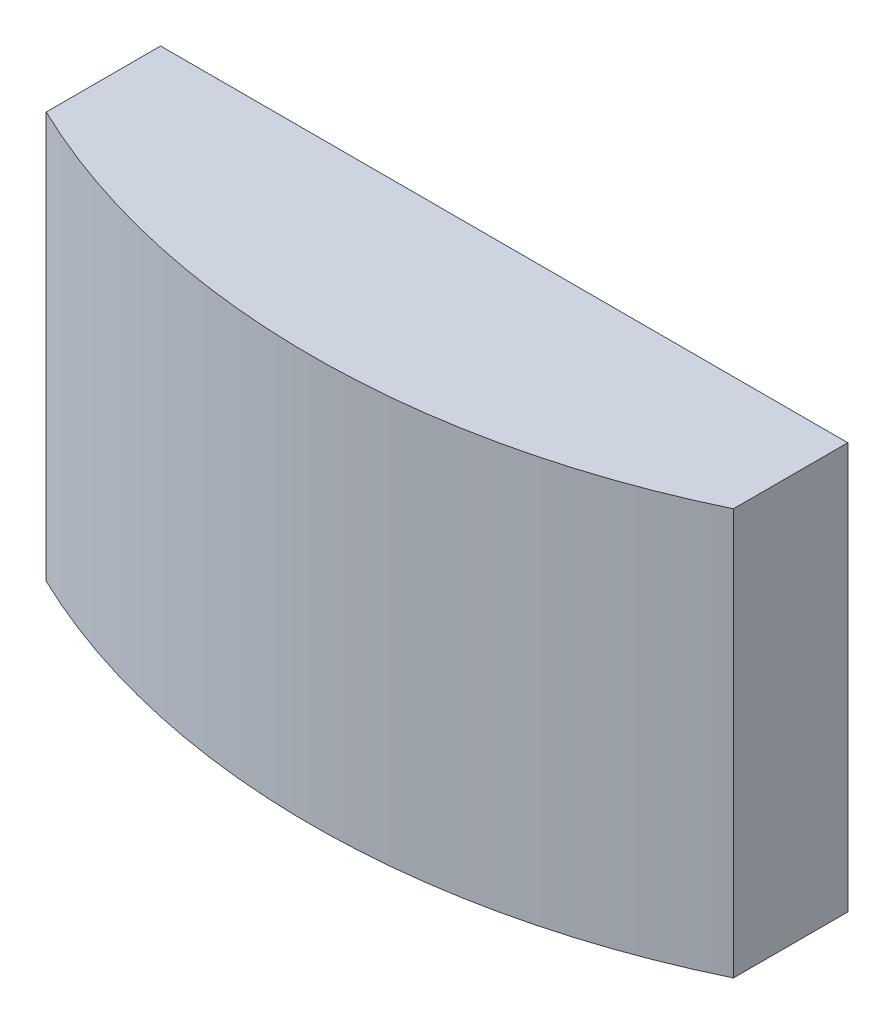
ISO-10303-21;
HEADER;
FILE_DESCRIPTION(('STEP AP214'),'2;1');
FILE_NAME('part.step','',(''),(''),'','','');
FILE_SCHEMA(('AUTOMOTIVE_DESIGN { 1 0 10303 214 1 1 1 1 }'));
ENDSEC;
DATA;
#1=APPLICATION_CONTEXT('core data for automotive mechanical design processes');
#2=APPLICATION_PROTOCOL_DEFINITION('international standard','automotive_design',2000,#1);
#3=PRODUCT_CONTEXT('',#1,'mechanical');
#4=PRODUCT('Part','Part','',(#3));
#5=PRODUCT_RELATED_PRODUCT_CATEGORY('part','',(#4));
#6=PRODUCT_DEFINITION_FORMATION('','',#4);
#7=PRODUCT_DEFINITION_CONTEXT('part definition',#1,'design');
#8=PRODUCT_DEFINITION('design','',#6,#7);
#9=PRODUCT_DEFINITION_SHAPE('','',#8);
#10=(LENGTH_UNIT() NAMED_UNIT(*) SI_UNIT(.MILLI.,.METRE.));
#11=(NAMED_UNIT(*) PLANE_ANGLE_UNIT() SI_UNIT($,.RADIAN.));
#12=(NAMED_UNIT(*) SI_UNIT($,.STERADIAN.) SOLID_ANGLE_UNIT());
#13=UNCERTAINTY_MEASURE_WITH_UNIT(LENGTH_MEASURE(1.E-05),#10,'distance_accuracy_value','');
#14=(GEOMETRIC_REPRESENTATION_CONTEXT(3) GLOBAL_UNCERTAINTY_ASSIGNED_CONTEXT((#13)) GLOBAL_UNIT_ASSIGNED_CONTEXT((#10,
#11,#12)) REPRESENTATION_CONTEXT('',''));
#15=CARTESIAN_POINT('',(0.,0.,0.));
#16=DIRECTION('',(0.,0.,1.));
#17=DIRECTION('',(1.,0.,0.));
#18=AXIS2_PLACEMENT_3D('',#15,#16,#17);
#19=CARTESIAN_POINT('',(-76.5655042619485,90.5480350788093,0.));
#20=DIRECTION('',(1.,0.,0.));
#21=DIRECTION('',(0.,0.,-1.));
#22=AXIS2_PLACEMENT_3D('',#19,#20,#21);
#23=PLANE('',#22);
#24=DIRECTION('',(0.,0.,1.));
#25=VECTOR('',#24,1.);
#26=CARTESIAN_POINT('',(-76.5655042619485,0.,0.));
#27=LINE('',#26,#25);
#28=CARTESIAN_POINT('',(-76.5655042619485,0.,0.));
#29=VERTEX_POINT('',#28);
#30=CARTESIAN_POINT('',(-76.5655042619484,0.,25.4871188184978));
#31=VERTEX_POINT('',#30);
#32=EDGE_CURVE('E70',#29,#31,#27,.T.);
#33=ORIENTED_EDGE('',*,*,#32,.T.);
#34=DIRECTION('',(0.,-1.,0.));
#35=VECTOR('',#34,1.);
#36=CARTESIAN_POINT('',(-76.5655042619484,90.5480350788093,25.4871188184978));
#37=LINE('',#36,#35);
#38=CARTESIAN_POINT('',(-76.5655042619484,90.5480350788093,25.4871188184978));
#39=VERTEX_POINT('',#38);
#40=EDGE_CURVE('E11',#39,#31,#37,.T.);
#41=ORIENTED_EDGE('',*,*,#40,.F.);
#42=DIRECTION('',(0.,0.,1.));
#43=VECTOR('',#42,1.);
#44=CARTESIAN_POINT('',(-76.5655042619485,90.5480350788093,0.));
#45=LINE('',#44,#43);
#46=CARTESIAN_POINT('',(-76.5655042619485,90.5480350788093,0.));
#47=VERTEX_POINT('',#46);
#48=EDGE_CURVE('E88',#47,#39,#45,.T.);
#49=ORIENTED_EDGE('',*,*,#48,.F.);
#50=DIRECTION('',(0.,-1.,0.));
#51=VECTOR('',#50,1.);
#52=CARTESIAN_POINT('',(-76.5655042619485,90.5480350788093,0.));
#53=LINE('',#52,#51);
#54=EDGE_CURVE('E82',#47,#29,#53,.T.);
#55=ORIENTED_EDGE('',*,*,#54,.T.);
#56=EDGE_LOOP('',(#33,#41,#49,#55));
#57=FACE_BOUND('',#56,.T.);
#58=ADVANCED_FACE('F26',(#57),#23,.F.);
#59=CARTESIAN_POINT('',(0.,90.5480350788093,-133.49916290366));
#60=DIRECTION('',(0.,-1.,0.));
#61=DIRECTION('',(0.,0.,-1.));
#62=AXIS2_PLACEMENT_3D('',#59,#60,#61);
#63=CYLINDRICAL_SURFACE('',#62,176.462217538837);
#64=CARTESIAN_POINT('',(0.,0.,-133.49916290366));
#65=DIRECTION('',(0.,1.,0.));
#66=DIRECTION('',(0.,0.,1.));
#67=AXIS2_PLACEMENT_3D('',#64,#65,#66);
#68=CIRCLE('',#67,176.462217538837);
#69=CARTESIAN_POINT('',(76.5655042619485,0.,25.4871188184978));
#70=VERTEX_POINT('',#69);
#71=EDGE_CURVE('E66',#31,#70,#68,.T.);
#72=ORIENTED_EDGE('',*,*,#71,.T.);
#73=DIRECTION('',(0.,-1.,0.));
#74=VECTOR('',#73,1.);
#75=CARTESIAN_POINT('',(76.5655042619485,90.5480350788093,25.4871188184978));
#76=LINE('',#75,#74);
#77=CARTESIAN_POINT('',(76.5655042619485,90.5480350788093,25.4871188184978));
#78=VERTEX_POINT('',#77);
#79=EDGE_CURVE('E33',#78,#70,#76,.T.);
#80=ORIENTED_EDGE('',*,*,#79,.F.);
#81=CARTESIAN_POINT('',(0.,90.5480350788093,-133.49916290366));
#82=DIRECTION('',(0.,1.,0.));
#83=DIRECTION('',(0.,0.,1.));
#84=AXIS2_PLACEMENT_3D('',#81,#82,#83);
#85=CIRCLE('',#84,176.462217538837);
#86=EDGE_CURVE('E78',#39,#78,#85,.T.);
#87=ORIENTED_EDGE('',*,*,#86,.F.);
#88=ORIENTED_EDGE('',*,*,#40,.T.);
#89=EDGE_LOOP('',(#72,#80,#87,#88));
#90=FACE_BOUND('',#89,.T.);
#91=ADVANCED_FACE('F77',(#90),#63,.T.);
#92=CARTESIAN_POINT('',(76.5655042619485,90.5480350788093,0.));
#93=DIRECTION('',(-1.,0.,0.));
#94=DIRECTION('',(0.,0.,1.));
#95=AXIS2_PLACEMENT_3D('',#92,#93,#94);
#96=PLANE('',#95);
#97=DIRECTION('',(0.,0.,-1.));
#98=VECTOR('',#97,1.);
#99=CARTESIAN_POINT('',(76.5655042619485,0.,0.));
#100=LINE('',#99,#98);
#101=CARTESIAN_POINT('',(76.5655042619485,0.,0.));
#102=VERTEX_POINT('',#101);
#103=EDGE_CURVE('E71',#70,#102,#100,.T.);
#104=ORIENTED_EDGE('',*,*,#103,.T.);
#105=DIRECTION('',(0.,-1.,0.));
#106=VECTOR('',#105,1.);
#107=CARTESIAN_POINT('',(76.5655042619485,90.5480350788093,0.));
#108=LINE('',#107,#106);
#109=CARTESIAN_POINT('',(76.5655042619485,90.5480350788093,0.));
#110=VERTEX_POINT('',#109);
#111=EDGE_CURVE('E94',#110,#102,#108,.T.);
#112=ORIENTED_EDGE('',*,*,#111,.F.);
#113=DIRECTION('',(0.,0.,-1.));
#114=VECTOR('',#113,1.);
#115=CARTESIAN_POINT('',(76.5655042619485,90.5480350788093,0.));
#116=LINE('',#115,#114);
#117=EDGE_CURVE('E45',#78,#110,#116,.T.);
#118=ORIENTED_EDGE('',*,*,#117,.F.);
#119=ORIENTED_EDGE('',*,*,#79,.T.);
#120=EDGE_LOOP('',(#104,#112,#118,#119));
#121=FACE_BOUND('',#120,.T.);
#122=ADVANCED_FACE('F97',(#121),#96,.F.);
#123=CARTESIAN_POINT('',(-76.5655042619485,90.5480350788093,0.));
#124=DIRECTION('',(0.,0.,1.));
#125=DIRECTION('',(1.,0.,0.));
#126=AXIS2_PLACEMENT_3D('',#123,#124,#125);
#127=PLANE('',#126);
#128=DIRECTION('',(-1.,0.,0.));
#129=VECTOR('',#128,1.);
#130=CARTESIAN_POINT('',(-76.5655042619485,0.,0.));
#131=LINE('',#130,#129);
#132=EDGE_CURVE('E86',#102,#29,#131,.T.);
#133=ORIENTED_EDGE('',*,*,#132,.T.);
#134=ORIENTED_EDGE('',*,*,#54,.F.);
#135=DIRECTION('',(-1.,0.,0.));
#136=VECTOR('',#135,1.);
#137=CARTESIAN_POINT('',(-76.5655042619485,90.5480350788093,0.));
#138=LINE('',#137,#136);
#139=EDGE_CURVE('E40',#110,#47,#138,.T.);
#140=ORIENTED_EDGE('',*,*,#139,.F.);
#141=ORIENTED_EDGE('',*,*,#111,.T.);
#142=EDGE_LOOP('',(#133,#134,#140,#141));
#143=FACE_BOUND('',#142,.T.);
#144=ADVANCED_FACE('F99',(#143),#127,.F.);
#145=CARTESIAN_POINT('',(0.,90.5480350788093,-133.49916290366));
#146=DIRECTION('',(0.,1.,0.));
#147=DIRECTION('',(0.,0.,1.));
#148=AXIS2_PLACEMENT_3D('',#145,#146,#147);
#149=PLANE('',#148);
#150=ORIENTED_EDGE('',*,*,#48,.T.);
#151=ORIENTED_EDGE('',*,*,#86,.T.);
#152=ORIENTED_EDGE('',*,*,#117,.T.);
#153=ORIENTED_EDGE('',*,*,#139,.T.);
#154=EDGE_LOOP('',(#150,#151,#152,#153));
#155=FACE_BOUND('',#154,.T.);
#156=ADVANCED_FACE('F100',(#155),#149,.T.);
#157=CARTESIAN_POINT('',(0.,0.,-133.49916290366));
#158=DIRECTION('',(0.,1.,0.));
#159=DIRECTION('',(0.,0.,1.));
#160=AXIS2_PLACEMENT_3D('',#157,#158,#159);
#161=PLANE('',#160);
#162=ORIENTED_EDGE('',*,*,#32,.F.);
#163=ORIENTED_EDGE('',*,*,#132,.F.);
#164=ORIENTED_EDGE('',*,*,#103,.F.);
#165=ORIENTED_EDGE('',*,*,#71,.F.);
#166=EDGE_LOOP('',(#162,#163,#164,#165));
#167=FACE_BOUND('',#166,.T.);
#168=ADVANCED_FACE('F67',(#167),#161,.F.);
#169=CLOSED_SHELL('',(#58,#91,#122,#144,#156,#168));
#170=MANIFOLD_SOLID_BREP('B2',#169);
#171=ADVANCED_BREP_SHAPE_REPRESENTATION('',(#18,#170),#14);
#172=SHAPE_DEFINITION_REPRESENTATION(#9,#171);
ENDSEC;
END-ISO-10303-21;
